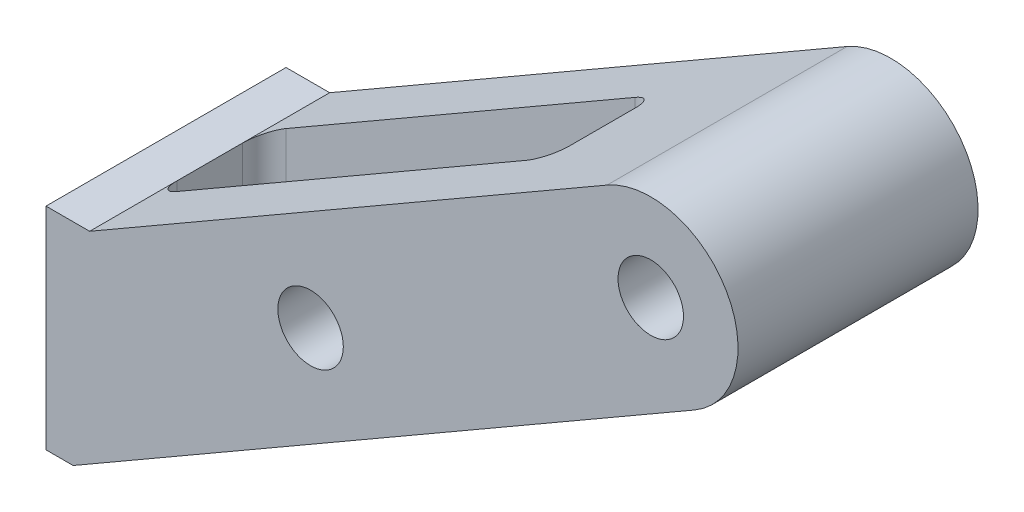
from build123d import *

# Parameters (mm, degrees)
BASE_DEPTH        = 11
PASSAGE_AXE_D     = 6
POCHE_DEPTH       = 76.787927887
POCHE_DEPTH_BACK  = 76.787927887
ESQUISSE6_R       = 15
PASAGE_TIGE_DEPTH = 76.787927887


with BuildPart() as part:
    # Esquisse1 → BASE (new, symmetric)
    with BuildSketch(Plane.XY):
        with BuildLine():
            Line((4, 11.547005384), (51.425625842, 38.92820323))
            ThreePointArc((51.425625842, 38.92820323), (62.353829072, 36), (59.425625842, 25.07179677))
            Line((59.425625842, 25.07179677), (0, -9.237604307))
            Line((0, -9.237604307), (0, 11.547005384))
            Line((0, 11.547005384), (4, 11.547005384))
        make_face()
    extrude(amount=BASE_DEPTH, both=True)

    # passage axe (through all)
    with Locations(Plane.XY.offset(11)):
        with Locations((55.425625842, 32), (24.248711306, 14)):
            Hole(PASSAGE_AXE_D / 2)

    # Esquisse5 → POCHE (cut, two sides: drawn at the far end of the back side and taken through both)
    with BuildSketch(Plane.ZX.offset(-POCHE_DEPTH_BACK)):
        with BuildLine():
            Line((3, 4), (-3, 4))
            ThreePointArc((-3, 4), (-4.414213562, 4.585786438), (-5, 6))
            Line((-5, 6), (-5, 38))
            ThreePointArc((-5, 38), (-4.414213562, 39.414213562), (-3, 40))
            Line((-3, 40), (3, 40))
            ThreePointArc((3, 40), (4.414213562, 39.414213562), (5, 38))
            Line((5, 38), (5, 6))
            ThreePointArc((5, 6), (4.414213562, 4.585786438), (3, 4))
        make_face()
    extrude(amount=POCHE_DEPTH + POCHE_DEPTH_BACK, mode=Mode.SUBTRACT)

    # Esquisse6 → PASAGE TIGE (cut, through all)
    with BuildSketch(Plane.ZY):
        with Locations((0, -18)):
            Circle(ESQUISSE6_R)
    extrude(amount=-PASAGE_TIGE_DEPTH, mode=Mode.SUBTRACT)


solid = part.part
